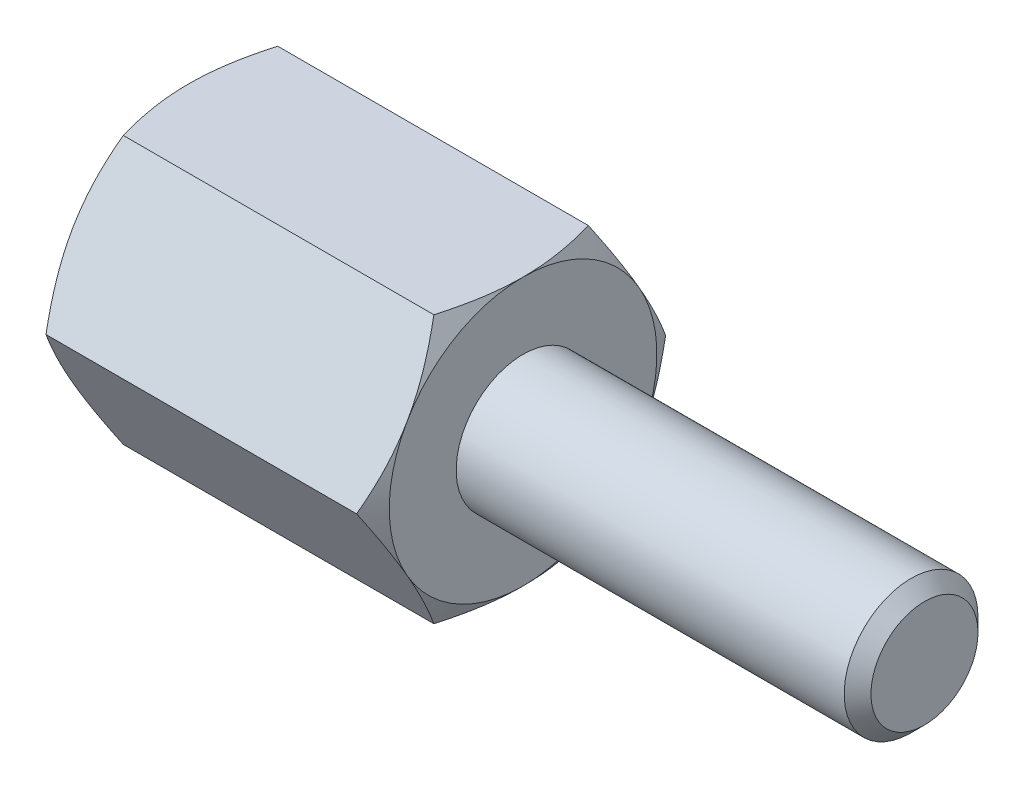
ISO-10303-21;
HEADER;
FILE_DESCRIPTION(('STEP AP214'),'2;1');
FILE_NAME('part.step','',(''),(''),'','','');
FILE_SCHEMA(('AUTOMOTIVE_DESIGN { 1 0 10303 214 1 1 1 1 }'));
ENDSEC;
DATA;
#1=APPLICATION_CONTEXT('core data for automotive mechanical design processes');
#2=APPLICATION_PROTOCOL_DEFINITION('international standard','automotive_design',2000,#1);
#3=PRODUCT_CONTEXT('',#1,'mechanical');
#4=PRODUCT('Part','Part','',(#3));
#5=PRODUCT_RELATED_PRODUCT_CATEGORY('part','',(#4));
#6=PRODUCT_DEFINITION_FORMATION('','',#4);
#7=PRODUCT_DEFINITION_CONTEXT('part definition',#1,'design');
#8=PRODUCT_DEFINITION('design','',#6,#7);
#9=PRODUCT_DEFINITION_SHAPE('','',#8);
#10=(LENGTH_UNIT() NAMED_UNIT(*) SI_UNIT(.MILLI.,.METRE.));
#11=(NAMED_UNIT(*) PLANE_ANGLE_UNIT() SI_UNIT($,.RADIAN.));
#12=(NAMED_UNIT(*) SI_UNIT($,.STERADIAN.) SOLID_ANGLE_UNIT());
#13=UNCERTAINTY_MEASURE_WITH_UNIT(LENGTH_MEASURE(1.E-05),#10,'distance_accuracy_value','');
#14=(GEOMETRIC_REPRESENTATION_CONTEXT(3) GLOBAL_UNCERTAINTY_ASSIGNED_CONTEXT((#13)) GLOBAL_UNIT_ASSIGNED_CONTEXT((#10,
#11,#12)) REPRESENTATION_CONTEXT('',''));
#15=CARTESIAN_POINT('',(0.,0.,0.));
#16=DIRECTION('',(0.,0.,1.));
#17=DIRECTION('',(1.,0.,0.));
#18=AXIS2_PLACEMENT_3D('',#15,#16,#17);
#19=CARTESIAN_POINT('',(2.5,2.,-1.15470053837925));
#20=DIRECTION('',(1.,0.,0.));
#21=DIRECTION('',(0.,0.,-1.));
#22=AXIS2_PLACEMENT_3D('',#19,#20,#21);
#23=PLANE('',#22);
#24=CARTESIAN_POINT('',(2.5,0.,0.));
#25=DIRECTION('',(1.,0.,0.));
#26=DIRECTION('',(0.,0.,-1.));
#27=AXIS2_PLACEMENT_3D('',#24,#25,#26);
#28=CIRCLE('',#27,2.);
#29=CARTESIAN_POINT('',(2.5,-1.,-1.73205080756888));
#30=VERTEX_POINT('',#29);
#31=CARTESIAN_POINT('',(2.5,1.,-1.73205080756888));
#32=VERTEX_POINT('',#31);
#33=EDGE_CURVE('E288',#30,#32,#28,.T.);
#34=ORIENTED_EDGE('',*,*,#33,.T.);
#35=CARTESIAN_POINT('',(2.5,2.,0.));
#36=VERTEX_POINT('',#35);
#37=EDGE_CURVE('E53',#32,#36,#28,.T.);
#38=ORIENTED_EDGE('',*,*,#37,.T.);
#39=CARTESIAN_POINT('',(2.5,1.,1.73205080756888));
#40=VERTEX_POINT('',#39);
#41=EDGE_CURVE('E297',#36,#40,#28,.T.);
#42=ORIENTED_EDGE('',*,*,#41,.T.);
#43=CARTESIAN_POINT('',(2.5,-1.,1.73205080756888));
#44=VERTEX_POINT('',#43);
#45=EDGE_CURVE('E303',#40,#44,#28,.T.);
#46=ORIENTED_EDGE('',*,*,#45,.T.);
#47=CARTESIAN_POINT('',(2.5,0.,0.));
#48=DIRECTION('',(-1.,0.,0.));
#49=DIRECTION('',(0.,-1.,0.));
#50=AXIS2_PLACEMENT_3D('',#47,#48,#49);
#51=CIRCLE('',#50,2.);
#52=CARTESIAN_POINT('',(2.5,-2.,0.));
#53=VERTEX_POINT('',#52);
#54=EDGE_CURVE('E193',#53,#44,#51,.T.);
#55=ORIENTED_EDGE('',*,*,#54,.F.);
#56=EDGE_CURVE('E61',#53,#30,#28,.T.);
#57=ORIENTED_EDGE('',*,*,#56,.T.);
#58=EDGE_LOOP('',(#34,#38,#42,#46,#55,#57));
#59=FACE_BOUND('',#58,.T.);
#60=CARTESIAN_POINT('',(2.5,0.,0.));
#61=DIRECTION('',(1.,0.,0.));
#62=DIRECTION('',(0.,0.,-1.));
#63=AXIS2_PLACEMENT_3D('',#60,#61,#62);
#64=CIRCLE('',#63,1.);
#65=CARTESIAN_POINT('',(2.5,0.,-1.));
#66=VERTEX_POINT('',#65);
#67=EDGE_CURVE('E320',#66,#66,#64,.T.);
#68=ORIENTED_EDGE('',*,*,#67,.F.);
#69=EDGE_LOOP('',(#68));
#70=FACE_BOUND('',#69,.T.);
#71=ADVANCED_FACE('F37',(#59,#70),#23,.T.);
#72=CARTESIAN_POINT('',(2.5,0.,-2.3094010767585));
#73=DIRECTION('',(0.,-0.5,0.866025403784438));
#74=DIRECTION('',(0.,-0.866025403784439,-0.5));
#75=AXIS2_PLACEMENT_3D('',#72,#73,#74);
#76=PLANE('',#75);
#77=CARTESIAN_POINT('',(2.3213005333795,-0.00020000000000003,-2.30951654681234));
#78=CARTESIAN_POINT('',(2.35061046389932,0.0876912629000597,-2.25877250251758));
#79=CARTESIAN_POINT('',(2.37726714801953,0.176341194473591,-2.20759044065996));
#80=CARTESIAN_POINT('',(2.42379750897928,0.355176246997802,-2.10433997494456));
#81=CARTESIAN_POINT('',(2.44365472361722,0.445364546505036,-2.05226973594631));
#82=CARTESIAN_POINT('',(2.47456653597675,0.624623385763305,-1.94877459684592));
#83=CARTESIAN_POINT('',(2.48582684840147,0.713666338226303,-1.89736562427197));
#84=CARTESIAN_POINT('',(2.49927133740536,0.892171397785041,-1.79430568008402));
#85=CARTESIAN_POINT('',(2.50146664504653,0.981632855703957,-1.74265508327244));
#86=CARTESIAN_POINT('',(2.49690901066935,1.1488083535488,-1.64613626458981));
#87=CARTESIAN_POINT('',(2.49127512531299,1.22654737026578,-1.60125362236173));
#88=CARTESIAN_POINT('',(2.47341610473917,1.38151891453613,-1.51178075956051));
#89=CARTESIAN_POINT('',(2.46118486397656,1.4587509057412,-1.46719084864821));
#90=CARTESIAN_POINT('',(2.43060656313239,1.6140421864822,-1.37753338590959));
#91=CARTESIAN_POINT('',(2.41212983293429,1.69208181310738,-1.33247718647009));
#92=CARTESIAN_POINT('',(2.37019448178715,1.84699686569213,-1.24303693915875));
#93=CARTESIAN_POINT('',(2.34674571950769,1.92387427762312,-1.1986517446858));
#94=CARTESIAN_POINT('',(2.32130053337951,2.0002,-1.15458506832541));
#95=B_SPLINE_CURVE_WITH_KNOTS('',3,(#77,#78,#79,#80,#81,#82,#83,#84,#85,#86,#87,#88,#89,#90,#91,
#92,#93,#94),.UNSPECIFIED.,.F.,.F.,(4,2,2,2,2,2,2,2,4),(0.,0.317031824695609,0.634825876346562,
0.944753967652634,1.25430138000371,1.52387047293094,1.79368946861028,2.06949491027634,
2.34475850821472),.UNSPECIFIED.);
#96=CARTESIAN_POINT('',(2.32136720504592,0.,-2.3094010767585));
#97=VERTEX_POINT('',#96);
#98=EDGE_CURVE('E328',#97,#32,#95,.T.);
#99=ORIENTED_EDGE('',*,*,#98,.F.);
#100=DIRECTION('',(-1.,0.,0.));
#101=VECTOR('',#100,1.);
#102=CARTESIAN_POINT('',(2.5,0.,-2.3094010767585));
#103=LINE('',#102,#101);
#104=CARTESIAN_POINT('',(-2.32136720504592,0.,-2.3094010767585));
#105=VERTEX_POINT('',#104);
#106=EDGE_CURVE('E264',#97,#105,#103,.T.);
#107=ORIENTED_EDGE('',*,*,#106,.T.);
#108=CARTESIAN_POINT('',(-2.3213005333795,2.0002,-1.15458506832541));
#109=CARTESIAN_POINT('',(-2.35061046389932,1.91230873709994,-1.20532911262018));
#110=CARTESIAN_POINT('',(-2.37726714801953,1.82365880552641,-1.2565111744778));
#111=CARTESIAN_POINT('',(-2.42379750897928,1.6448237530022,-1.35976164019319));
#112=CARTESIAN_POINT('',(-2.44365472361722,1.55463545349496,-1.41183187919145));
#113=CARTESIAN_POINT('',(-2.47456653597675,1.37537661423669,-1.51532701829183));
#114=CARTESIAN_POINT('',(-2.48582684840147,1.2863336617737,-1.56673599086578));
#115=CARTESIAN_POINT('',(-2.49927133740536,1.10782860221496,-1.66979593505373));
#116=CARTESIAN_POINT('',(-2.50146664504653,1.01836714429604,-1.72144653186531));
#117=CARTESIAN_POINT('',(-2.49690901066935,0.851191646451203,-1.81796535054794));
#118=CARTESIAN_POINT('',(-2.49127512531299,0.773452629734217,-1.86284799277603));
#119=CARTESIAN_POINT('',(-2.47341610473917,0.618481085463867,-1.95232085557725));
#120=CARTESIAN_POINT('',(-2.46118486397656,0.541249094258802,-1.99691076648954));
#121=CARTESIAN_POINT('',(-2.43060656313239,0.3859578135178,-2.08656822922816));
#122=CARTESIAN_POINT('',(-2.41212983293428,0.307918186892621,-2.13162442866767));
#123=CARTESIAN_POINT('',(-2.37019448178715,0.153003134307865,-2.221064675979));
#124=CARTESIAN_POINT('',(-2.34674571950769,0.07612572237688,-2.26544987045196));
#125=CARTESIAN_POINT('',(-2.3213005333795,-0.000199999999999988,-2.30951654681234));
#126=B_SPLINE_CURVE_WITH_KNOTS('',3,(#108,#109,#110,#111,#112,#113,#114,#115,#116,#117,#118,
#119,#120,#121,#122,#123,#124,#125),.UNSPECIFIED.,.F.,.F.,(4,2,2,2,2,2,2,2,4),(0.,
0.317031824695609,0.634825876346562,0.944753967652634,1.25430138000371,1.52387047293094,
1.79368946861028,2.06949491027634,2.34475850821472),.UNSPECIFIED.);
#127=CARTESIAN_POINT('',(-2.5,1.,-1.73205080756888));
#128=VERTEX_POINT('',#127);
#129=EDGE_CURVE('E380',#128,#105,#126,.T.);
#130=ORIENTED_EDGE('',*,*,#129,.F.);
#131=CARTESIAN_POINT('',(-2.32136720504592,2.,-1.15470053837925));
#132=VERTEX_POINT('',#131);
#133=EDGE_CURVE('E382',#132,#128,#126,.T.);
#134=ORIENTED_EDGE('',*,*,#133,.F.);
#135=DIRECTION('',(-1.,0.,0.));
#136=VECTOR('',#135,1.);
#137=CARTESIAN_POINT('',(2.5,2.,-1.15470053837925));
#138=LINE('',#137,#136);
#139=CARTESIAN_POINT('',(2.321367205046,2.,-1.15470053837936));
#140=VERTEX_POINT('',#139);
#141=EDGE_CURVE('E279',#140,#132,#138,.T.);
#142=ORIENTED_EDGE('',*,*,#141,.F.);
#143=EDGE_CURVE('E229',#32,#140,#95,.T.);
#144=ORIENTED_EDGE('',*,*,#143,.F.);
#145=EDGE_LOOP('',(#99,#107,#130,#134,#142,#144));
#146=FACE_BOUND('',#145,.T.);
#147=ADVANCED_FACE('F148',(#146),#76,.F.);
#148=CARTESIAN_POINT('',(2.5,2.,-1.15470053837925));
#149=DIRECTION('',(0.,-1.,0.));
#150=DIRECTION('',(0.,0.,-1.));
#151=AXIS2_PLACEMENT_3D('',#148,#149,#150);
#152=PLANE('',#151);
#153=CARTESIAN_POINT('',(1.50414535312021,2.,-3.14239762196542));
#154=CARTESIAN_POINT('',(1.5468568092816,2.,-3.05468337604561));
#155=CARTESIAN_POINT('',(1.58917030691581,2.,-2.96677207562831));
#156=CARTESIAN_POINT('',(1.67277831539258,2.,-2.79045070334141));
#157=CARTESIAN_POINT('',(1.71407267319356,2.,-2.70204055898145));
#158=CARTESIAN_POINT('',(1.79561838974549,2.,-2.52418069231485));
#159=CARTESIAN_POINT('',(1.83586319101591,2.,-2.43472795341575));
#160=CARTESIAN_POINT('',(1.91475904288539,2.,-2.25512498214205));
#161=CARTESIAN_POINT('',(1.95341016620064,2.,-2.16497478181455));
#162=CARTESIAN_POINT('',(2.02996617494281,2.,-1.98078525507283));
#163=CARTESIAN_POINT('',(2.06780217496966,2.,-1.88671714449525));
#164=CARTESIAN_POINT('',(2.14070044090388,2.,-1.69751412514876));
#165=CARTESIAN_POINT('',(2.17576294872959,2.,-1.60237931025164));
#166=CARTESIAN_POINT('',(2.24223535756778,2.,-1.41102905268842));
#167=CARTESIAN_POINT('',(2.27365196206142,2.,-1.31481596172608));
#168=CARTESIAN_POINT('',(2.33184764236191,2.,-1.12101028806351));
#169=CARTESIAN_POINT('',(2.3586281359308,2.,-1.02341813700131));
#170=CARTESIAN_POINT('',(2.40615162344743,2.,-0.827336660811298));
#171=CARTESIAN_POINT('',(2.4269281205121,2.,-0.728855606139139));
#172=CARTESIAN_POINT('',(2.46129559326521,2.,-0.530628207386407));
#173=CARTESIAN_POINT('',(2.47488733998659,2.,-0.430882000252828));
#174=CARTESIAN_POINT('',(2.49362159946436,2.,-0.231937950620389));
#175=CARTESIAN_POINT('',(2.49887592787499,2.,-0.132750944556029));
#176=CARTESIAN_POINT('',(2.50079968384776,2.,0.0657049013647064));
#177=CARTESIAN_POINT('',(2.4974689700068,2.,0.164973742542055));
#178=CARTESIAN_POINT('',(2.47965125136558,2.,0.4006926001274));
#179=CARTESIAN_POINT('',(2.46138848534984,2.,0.536859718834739));
#180=CARTESIAN_POINT('',(2.41179958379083,2.,0.806792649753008));
#181=CARTESIAN_POINT('',(2.38046153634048,2.,0.940556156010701));
#182=CARTESIAN_POINT('',(2.30733694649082,2.,1.20849227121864));
#183=CARTESIAN_POINT('',(2.26532316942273,2.,1.34260127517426));
#184=CARTESIAN_POINT('',(2.19701155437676,2.,1.54188460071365));
#185=CARTESIAN_POINT('',(2.17336125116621,2.,1.6079939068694));
#186=CARTESIAN_POINT('',(2.12457310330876,2.,1.73966131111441));
#187=CARTESIAN_POINT('',(2.09943529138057,2.,1.80521942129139));
#188=CARTESIAN_POINT('',(2.03045244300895,2.,1.98014362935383));
#189=CARTESIAN_POINT('',(1.98548288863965,2.,2.08906517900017));
#190=CARTESIAN_POINT('',(1.89293953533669,2.,2.3058004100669));
#191=CARTESIAN_POINT('',(1.84536546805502,2.,2.41361397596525));
#192=CARTESIAN_POINT('',(1.74822629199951,2.,2.62838132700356));
#193=CARTESIAN_POINT('',(1.69866051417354,2.,2.73533480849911));
#194=CARTESIAN_POINT('',(1.59800140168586,2.,2.94852186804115));
#195=CARTESIAN_POINT('',(1.54690802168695,2.,3.05475542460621));
#196=CARTESIAN_POINT('',(1.39169615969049,2.,3.37291303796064));
#197=CARTESIAN_POINT('',(1.28579652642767,2.,3.58396705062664));
#198=CARTESIAN_POINT('',(1.07100981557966,2.,4.00448363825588));
#199=CARTESIAN_POINT('',(0.962123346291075,2.,4.21394652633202));
#200=CARTESIAN_POINT('',(0.753767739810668,2.,4.61000648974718));
#201=CARTESIAN_POINT('',(0.654500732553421,2.,4.79671008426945));
#202=CARTESIAN_POINT('',(0.454764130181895,2.,5.16948614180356));
#203=CARTESIAN_POINT('',(0.354294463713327,2.,5.35555856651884));
#204=CARTESIAN_POINT('',(0.152793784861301,2.,5.72660635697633));
#205=CARTESIAN_POINT('',(0.051765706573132,2.,5.91158331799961));
#206=CARTESIAN_POINT('',(-0.15097604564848,2.,6.28114276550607));
#207=CARTESIAN_POINT('',(-0.252689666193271,2.,6.46572528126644));
#208=CARTESIAN_POINT('',(-0.35465292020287,2.,6.65016883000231));
#209=B_SPLINE_CURVE_WITH_KNOTS('',3,(#153,#154,#155,#156,#157,#158,#159,#160,#161,#162,#163,
#164,#165,#166,#167,#168,#169,#170,#171,#172,#173,#174,#175,#176,#177,#178,#179,#180,#181,#182,
#183,#184,#185,#186,#187,#188,#189,#190,#191,#192,#193,#194,#195,#196,#197,#198,#199,#200,#201,
#202,#203,#204,#205,#206,#207,#208),.UNSPECIFIED.,.F.,.F.,(4,2,2,2,2,2,2,2,2,2,2,2,2,2,2,2,2,2,
2,2,2,2,2,2,2,2,2,4),(0.,0.292684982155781,0.585413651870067,0.879667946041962,1.17390879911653,
1.47805164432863,1.78216793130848,2.08571589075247,2.38917085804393,2.690898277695,
2.99259331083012,3.29020694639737,3.58782548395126,3.99913738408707,4.41082482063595,
4.8321411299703,5.0427662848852,5.25338680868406,5.6068563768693,5.96036243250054,
6.31398824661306,6.66762456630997,7.37597688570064,8.08418599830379,8.71853756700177,
9.3529269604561,9.98522933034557,10.6174830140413),.UNSPECIFIED.);
#210=EDGE_CURVE('E227',#140,#36,#209,.T.);
#211=ORIENTED_EDGE('',*,*,#210,.F.);
#212=ORIENTED_EDGE('',*,*,#141,.T.);
#213=CARTESIAN_POINT('',(-1.50414535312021,2.,-3.14239762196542));
#214=CARTESIAN_POINT('',(-1.5468568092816,2.,-3.05468337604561));
#215=CARTESIAN_POINT('',(-1.58917030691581,2.,-2.96677207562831));
#216=CARTESIAN_POINT('',(-1.67277831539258,2.,-2.79045070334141));
#217=CARTESIAN_POINT('',(-1.71407267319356,2.,-2.70204055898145));
#218=CARTESIAN_POINT('',(-1.79561838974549,2.,-2.52418069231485));
#219=CARTESIAN_POINT('',(-1.83586319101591,2.,-2.43472795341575));
#220=CARTESIAN_POINT('',(-1.91475904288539,2.,-2.25512498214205));
#221=CARTESIAN_POINT('',(-1.95341016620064,2.,-2.16497478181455));
#222=CARTESIAN_POINT('',(-2.02996617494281,2.,-1.98078525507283));
#223=CARTESIAN_POINT('',(-2.06780217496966,2.,-1.88671714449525));
#224=CARTESIAN_POINT('',(-2.14070044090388,2.,-1.69751412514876));
#225=CARTESIAN_POINT('',(-2.17576294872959,2.,-1.60237931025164));
#226=CARTESIAN_POINT('',(-2.24223535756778,2.,-1.41102905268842));
#227=CARTESIAN_POINT('',(-2.27365196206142,2.,-1.31481596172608));
#228=CARTESIAN_POINT('',(-2.33184764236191,2.,-1.12101028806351));
#229=CARTESIAN_POINT('',(-2.3586281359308,2.,-1.02341813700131));
#230=CARTESIAN_POINT('',(-2.40615162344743,2.,-0.827336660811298));
#231=CARTESIAN_POINT('',(-2.4269281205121,2.,-0.728855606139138));
#232=CARTESIAN_POINT('',(-2.46129559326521,2.,-0.530628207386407));
#233=CARTESIAN_POINT('',(-2.47488733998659,2.,-0.430882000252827));
#234=CARTESIAN_POINT('',(-2.49362159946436,2.,-0.231937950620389));
#235=CARTESIAN_POINT('',(-2.49887592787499,2.,-0.132750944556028));
#236=CARTESIAN_POINT('',(-2.50079968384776,2.,0.0657049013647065));
#237=CARTESIAN_POINT('',(-2.4974689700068,2.,0.164973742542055));
#238=CARTESIAN_POINT('',(-2.47965125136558,2.,0.400692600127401));
#239=CARTESIAN_POINT('',(-2.46138848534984,2.,0.536859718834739));
#240=CARTESIAN_POINT('',(-2.41179958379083,2.,0.806792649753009));
#241=CARTESIAN_POINT('',(-2.38046153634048,2.,0.940556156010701));
#242=CARTESIAN_POINT('',(-2.30733694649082,2.,1.20849227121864));
#243=CARTESIAN_POINT('',(-2.26532316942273,2.,1.34260127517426));
#244=CARTESIAN_POINT('',(-2.19701155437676,2.,1.54188460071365));
#245=CARTESIAN_POINT('',(-2.17336125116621,2.,1.6079939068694));
#246=CARTESIAN_POINT('',(-2.12457310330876,2.,1.73966131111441));
#247=CARTESIAN_POINT('',(-2.09943529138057,2.,1.80521942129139));
#248=CARTESIAN_POINT('',(-2.03045244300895,2.,1.98014362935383));
#249=CARTESIAN_POINT('',(-1.98548288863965,2.,2.08906517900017));
#250=CARTESIAN_POINT('',(-1.89293953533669,2.,2.3058004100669));
#251=CARTESIAN_POINT('',(-1.84536546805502,2.,2.41361397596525));
#252=CARTESIAN_POINT('',(-1.74822629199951,2.,2.62838132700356));
#253=CARTESIAN_POINT('',(-1.69866051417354,2.,2.73533480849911));
#254=CARTESIAN_POINT('',(-1.59800140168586,2.,2.94852186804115));
#255=CARTESIAN_POINT('',(-1.54690802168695,2.,3.05475542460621));
#256=CARTESIAN_POINT('',(-1.39169615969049,2.,3.37291303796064));
#257=CARTESIAN_POINT('',(-1.28579652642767,2.,3.58396705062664));
#258=CARTESIAN_POINT('',(-1.07100981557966,2.,4.00448363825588));
#259=CARTESIAN_POINT('',(-0.962123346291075,2.,4.21394652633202));
#260=CARTESIAN_POINT('',(-0.753767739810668,2.,4.61000648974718));
#261=CARTESIAN_POINT('',(-0.65450073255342,2.,4.79671008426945));
#262=CARTESIAN_POINT('',(-0.454764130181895,2.,5.16948614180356));
#263=CARTESIAN_POINT('',(-0.354294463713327,2.,5.35555856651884));
#264=CARTESIAN_POINT('',(-0.152793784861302,2.,5.72660635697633));
#265=CARTESIAN_POINT('',(-0.051765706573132,2.,5.91158331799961));
#266=CARTESIAN_POINT('',(0.150976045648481,2.,6.28114276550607));
#267=CARTESIAN_POINT('',(0.252689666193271,2.,6.46572528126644));
#268=CARTESIAN_POINT('',(0.354652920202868,2.,6.65016883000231));
#269=B_SPLINE_CURVE_WITH_KNOTS('',3,(#213,#214,#215,#216,#217,#218,#219,#220,#221,#222,#223,
#224,#225,#226,#227,#228,#229,#230,#231,#232,#233,#234,#235,#236,#237,#238,#239,#240,#241,#242,
#243,#244,#245,#246,#247,#248,#249,#250,#251,#252,#253,#254,#255,#256,#257,#258,#259,#260,#261,
#262,#263,#264,#265,#266,#267,#268),.UNSPECIFIED.,.F.,.F.,(4,2,2,2,2,2,2,2,2,2,2,2,2,2,2,2,2,2,
2,2,2,2,2,2,2,2,2,4),(0.,0.292684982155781,0.585413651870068,0.879667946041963,1.17390879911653,
1.47805164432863,1.78216793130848,2.08571589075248,2.38917085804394,2.690898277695,
2.99259331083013,3.29020694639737,3.58782548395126,3.99913738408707,4.41082482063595,
4.8321411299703,5.0427662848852,5.25338680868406,5.6068563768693,5.96036243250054,
6.31398824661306,6.66762456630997,7.37597688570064,8.08418599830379,8.71853756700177,
9.3529269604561,9.98522933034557,10.6174830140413),.UNSPECIFIED.);
#270=CARTESIAN_POINT('',(-2.5,2.,0.));
#271=VERTEX_POINT('',#270);
#272=EDGE_CURVE('E241',#271,#132,#269,.F.);
#273=ORIENTED_EDGE('',*,*,#272,.F.);
#274=CARTESIAN_POINT('',(-2.32136720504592,2.,1.15470053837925));
#275=VERTEX_POINT('',#274);
#276=EDGE_CURVE('E249',#275,#271,#269,.F.);
#277=ORIENTED_EDGE('',*,*,#276,.F.);
#278=DIRECTION('',(-1.,0.,0.));
#279=VECTOR('',#278,1.);
#280=CARTESIAN_POINT('',(2.5,2.,1.15470053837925));
#281=LINE('',#280,#279);
#282=CARTESIAN_POINT('',(2.32136720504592,2.,1.15470053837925));
#283=VERTEX_POINT('',#282);
#284=EDGE_CURVE('E276',#283,#275,#281,.T.);
#285=ORIENTED_EDGE('',*,*,#284,.F.);
#286=EDGE_CURVE('E221',#36,#283,#209,.T.);
#287=ORIENTED_EDGE('',*,*,#286,.F.);
#288=EDGE_LOOP('',(#211,#212,#273,#277,#285,#287));
#289=FACE_BOUND('',#288,.T.);
#290=ADVANCED_FACE('F153',(#289),#152,.F.);
#291=CARTESIAN_POINT('',(2.5,2.,1.15470053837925));
#292=DIRECTION('',(0.,-0.5,-0.866025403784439));
#293=DIRECTION('',(0.,0.866025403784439,-0.5));
#294=AXIS2_PLACEMENT_3D('',#291,#292,#293);
#295=PLANE('',#294);
#296=CARTESIAN_POINT('',(2.3213005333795,2.0002,1.15458506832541));
#297=CARTESIAN_POINT('',(2.35061046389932,1.91230873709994,1.20532911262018));
#298=CARTESIAN_POINT('',(2.37726714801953,1.82365880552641,1.2565111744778));
#299=CARTESIAN_POINT('',(2.42379750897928,1.6448237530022,1.35976164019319));
#300=CARTESIAN_POINT('',(2.44365472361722,1.55463545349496,1.41183187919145));
#301=CARTESIAN_POINT('',(2.47456653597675,1.37537661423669,1.51532701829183));
#302=CARTESIAN_POINT('',(2.48582684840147,1.2863336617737,1.56673599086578));
#303=CARTESIAN_POINT('',(2.49927133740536,1.10782860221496,1.66979593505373));
#304=CARTESIAN_POINT('',(2.50146664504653,1.01836714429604,1.72144653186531));
#305=CARTESIAN_POINT('',(2.49690901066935,0.851191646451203,1.81796535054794));
#306=CARTESIAN_POINT('',(2.49127512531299,0.773452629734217,1.86284799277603));
#307=CARTESIAN_POINT('',(2.47341610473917,0.618481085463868,1.95232085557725));
#308=CARTESIAN_POINT('',(2.46118486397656,0.541249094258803,1.99691076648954));
#309=CARTESIAN_POINT('',(2.43060656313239,0.3859578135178,2.08656822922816));
#310=CARTESIAN_POINT('',(2.41212983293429,0.307918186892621,2.13162442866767));
#311=CARTESIAN_POINT('',(2.37019448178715,0.153003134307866,2.221064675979));
#312=CARTESIAN_POINT('',(2.34674571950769,0.0761257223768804,2.26544987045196));
#313=CARTESIAN_POINT('',(2.3213005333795,-0.000199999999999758,2.30951654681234));
#314=B_SPLINE_CURVE_WITH_KNOTS('',3,(#296,#297,#298,#299,#300,#301,#302,#303,#304,#305,#306,
#307,#308,#309,#310,#311,#312,#313),.UNSPECIFIED.,.F.,.F.,(4,2,2,2,2,2,2,2,4),(0.,
0.317031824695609,0.634825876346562,0.944753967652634,1.25430138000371,1.52387047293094,
1.79368946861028,2.06949491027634,2.34475850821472),.UNSPECIFIED.);
#315=EDGE_CURVE('E228',#283,#40,#314,.T.);
#316=ORIENTED_EDGE('',*,*,#315,.F.);
#317=ORIENTED_EDGE('',*,*,#284,.T.);
#318=CARTESIAN_POINT('',(-2.3213005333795,-0.000199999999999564,2.30951654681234));
#319=CARTESIAN_POINT('',(-2.35061046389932,0.0876912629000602,2.25877250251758));
#320=CARTESIAN_POINT('',(-2.37726714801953,0.176341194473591,2.20759044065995));
#321=CARTESIAN_POINT('',(-2.42379750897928,0.355176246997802,2.10433997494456));
#322=CARTESIAN_POINT('',(-2.44365472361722,0.445364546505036,2.0522697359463));
#323=CARTESIAN_POINT('',(-2.47456653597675,0.624623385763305,1.94877459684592));
#324=CARTESIAN_POINT('',(-2.48582684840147,0.713666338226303,1.89736562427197));
#325=CARTESIAN_POINT('',(-2.49927133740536,0.892171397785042,1.79430568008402));
#326=CARTESIAN_POINT('',(-2.50146664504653,0.981632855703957,1.74265508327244));
#327=CARTESIAN_POINT('',(-2.49690901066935,1.1488083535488,1.64613626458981));
#328=CARTESIAN_POINT('',(-2.49127512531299,1.22654737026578,1.60125362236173));
#329=CARTESIAN_POINT('',(-2.47341610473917,1.38151891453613,1.51178075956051));
#330=CARTESIAN_POINT('',(-2.46118486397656,1.4587509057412,1.46719084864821));
#331=CARTESIAN_POINT('',(-2.43060656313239,1.6140421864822,1.37753338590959));
#332=CARTESIAN_POINT('',(-2.41212983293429,1.69208181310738,1.33247718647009));
#333=CARTESIAN_POINT('',(-2.37019448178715,1.84699686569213,1.24303693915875));
#334=CARTESIAN_POINT('',(-2.34674571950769,1.92387427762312,1.1986517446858));
#335=CARTESIAN_POINT('',(-2.32130053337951,2.0002,1.15458506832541));
#336=B_SPLINE_CURVE_WITH_KNOTS('',3,(#318,#319,#320,#321,#322,#323,#324,#325,#326,#327,#328,
#329,#330,#331,#332,#333,#334,#335),.UNSPECIFIED.,.F.,.F.,(4,2,2,2,2,2,2,2,4),(0.,
0.317031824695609,0.634825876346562,0.944753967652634,1.25430138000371,1.52387047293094,
1.79368946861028,2.06949491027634,2.34475850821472),.UNSPECIFIED.);
#337=CARTESIAN_POINT('',(-2.5,1.,1.73205080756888));
#338=VERTEX_POINT('',#337);
#339=EDGE_CURVE('E255',#338,#275,#336,.T.);
#340=ORIENTED_EDGE('',*,*,#339,.F.);
#341=CARTESIAN_POINT('',(-2.32136720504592,0.,2.3094010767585));
#342=VERTEX_POINT('',#341);
#343=EDGE_CURVE('E262',#342,#338,#336,.T.);
#344=ORIENTED_EDGE('',*,*,#343,.F.);
#345=DIRECTION('',(-1.,0.,0.));
#346=VECTOR('',#345,1.);
#347=CARTESIAN_POINT('',(2.5,0.,2.3094010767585));
#348=LINE('',#347,#346);
#349=CARTESIAN_POINT('',(2.32136720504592,0.,2.3094010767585));
#350=VERTEX_POINT('',#349);
#351=EDGE_CURVE('E273',#350,#342,#348,.T.);
#352=ORIENTED_EDGE('',*,*,#351,.F.);
#353=EDGE_CURVE('E215',#40,#350,#314,.T.);
#354=ORIENTED_EDGE('',*,*,#353,.F.);
#355=EDGE_LOOP('',(#316,#317,#340,#344,#352,#354));
#356=FACE_BOUND('',#355,.T.);
#357=ADVANCED_FACE('F235',(#356),#295,.F.);
#358=CARTESIAN_POINT('',(2.5,0.,2.3094010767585));
#359=DIRECTION('',(0.,0.5,-0.866025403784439));
#360=DIRECTION('',(0.,0.866025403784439,0.5));
#361=AXIS2_PLACEMENT_3D('',#358,#359,#360);
#362=PLANE('',#361);
#363=CARTESIAN_POINT('',(2.3213005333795,0.000200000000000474,2.30951654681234));
#364=CARTESIAN_POINT('',(2.35061046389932,-0.0876912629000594,2.25877250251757));
#365=CARTESIAN_POINT('',(2.37726714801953,-0.176341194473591,2.20759044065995));
#366=CARTESIAN_POINT('',(2.42379750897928,-0.355176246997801,2.10433997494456));
#367=CARTESIAN_POINT('',(2.44365472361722,-0.445364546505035,2.0522697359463));
#368=CARTESIAN_POINT('',(2.47456653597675,-0.624623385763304,1.94877459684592));
#369=CARTESIAN_POINT('',(2.48582684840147,-0.713666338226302,1.89736562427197));
#370=CARTESIAN_POINT('',(2.49927133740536,-0.892171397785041,1.79430568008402));
#371=CARTESIAN_POINT('',(2.50146664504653,-0.981632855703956,1.74265508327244));
#372=CARTESIAN_POINT('',(2.49690901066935,-1.1488083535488,1.64613626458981));
#373=CARTESIAN_POINT('',(2.49127512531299,-1.22654737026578,1.60125362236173));
#374=CARTESIAN_POINT('',(2.47341610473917,-1.38151891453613,1.51178075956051));
#375=CARTESIAN_POINT('',(2.46118486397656,-1.4587509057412,1.46719084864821));
#376=CARTESIAN_POINT('',(2.43060656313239,-1.6140421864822,1.37753338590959));
#377=CARTESIAN_POINT('',(2.41212983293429,-1.69208181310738,1.33247718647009));
#378=CARTESIAN_POINT('',(2.37019448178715,-1.84699686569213,1.24303693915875));
#379=CARTESIAN_POINT('',(2.34674571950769,-1.92387427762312,1.1986517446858));
#380=CARTESIAN_POINT('',(2.3213005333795,-2.0002,1.15458506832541));
#381=B_SPLINE_CURVE_WITH_KNOTS('',3,(#363,#364,#365,#366,#367,#368,#369,#370,#371,#372,#373,
#374,#375,#376,#377,#378,#379,#380),.UNSPECIFIED.,.F.,.F.,(4,2,2,2,2,2,2,2,4),(0.,
0.317031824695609,0.634825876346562,0.944753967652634,1.25430138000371,1.52387047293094,
1.79368946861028,2.06949491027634,2.34475850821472),.UNSPECIFIED.);
#382=EDGE_CURVE('E421',#350,#44,#381,.T.);
#383=ORIENTED_EDGE('',*,*,#382,.F.);
#384=ORIENTED_EDGE('',*,*,#351,.T.);
#385=CARTESIAN_POINT('',(-2.3213005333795,-2.0002,1.15458506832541));
#386=CARTESIAN_POINT('',(-2.35061046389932,-1.91230873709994,1.20532911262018));
#387=CARTESIAN_POINT('',(-2.37726714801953,-1.82365880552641,1.2565111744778));
#388=CARTESIAN_POINT('',(-2.42379750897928,-1.6448237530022,1.35976164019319));
#389=CARTESIAN_POINT('',(-2.44365472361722,-1.55463545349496,1.41183187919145));
#390=CARTESIAN_POINT('',(-2.47456653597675,-1.3753766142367,1.51532701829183));
#391=CARTESIAN_POINT('',(-2.48582684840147,-1.2863336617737,1.56673599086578));
#392=CARTESIAN_POINT('',(-2.49927133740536,-1.10782860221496,1.66979593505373));
#393=CARTESIAN_POINT('',(-2.50146664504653,-1.01836714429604,1.72144653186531));
#394=CARTESIAN_POINT('',(-2.49690901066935,-0.851191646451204,1.81796535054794));
#395=CARTESIAN_POINT('',(-2.49127512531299,-0.773452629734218,1.86284799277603));
#396=CARTESIAN_POINT('',(-2.47341610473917,-0.618481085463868,1.95232085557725));
#397=CARTESIAN_POINT('',(-2.46118486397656,-0.541249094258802,1.99691076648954));
#398=CARTESIAN_POINT('',(-2.43060656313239,-0.3859578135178,2.08656822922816));
#399=CARTESIAN_POINT('',(-2.41212983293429,-0.307918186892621,2.13162442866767));
#400=CARTESIAN_POINT('',(-2.37019448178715,-0.153003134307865,2.221064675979));
#401=CARTESIAN_POINT('',(-2.34674571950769,-0.0761257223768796,2.26544987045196));
#402=CARTESIAN_POINT('',(-2.3213005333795,0.000200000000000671,2.30951654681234));
#403=B_SPLINE_CURVE_WITH_KNOTS('',3,(#385,#386,#387,#388,#389,#390,#391,#392,#393,#394,#395,
#396,#397,#398,#399,#400,#401,#402),.UNSPECIFIED.,.F.,.F.,(4,2,2,2,2,2,2,2,4),(0.,
0.317031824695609,0.634825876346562,0.944753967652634,1.25430138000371,1.52387047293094,
1.79368946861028,2.06949491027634,2.34475850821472),.UNSPECIFIED.);
#404=CARTESIAN_POINT('',(-2.5,-1.,1.73205080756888));
#405=VERTEX_POINT('',#404);
#406=EDGE_CURVE('E263',#405,#342,#403,.T.);
#407=ORIENTED_EDGE('',*,*,#406,.F.);
#408=CARTESIAN_POINT('',(-2.32136720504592,-2.,1.15470053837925));
#409=VERTEX_POINT('',#408);
#410=EDGE_CURVE('E250',#409,#405,#403,.T.);
#411=ORIENTED_EDGE('',*,*,#410,.F.);
#412=DIRECTION('',(-1.,0.,0.));
#413=VECTOR('',#412,1.);
#414=CARTESIAN_POINT('',(2.5,-2.,1.15470053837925));
#415=LINE('',#414,#413);
#416=CARTESIAN_POINT('',(2.32136720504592,-2.,1.15470053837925));
#417=VERTEX_POINT('',#416);
#418=EDGE_CURVE('E270',#417,#409,#415,.T.);
#419=ORIENTED_EDGE('',*,*,#418,.F.);
#420=EDGE_CURVE('E210',#44,#417,#381,.T.);
#421=ORIENTED_EDGE('',*,*,#420,.F.);
#422=EDGE_LOOP('',(#383,#384,#407,#411,#419,#421));
#423=FACE_BOUND('',#422,.T.);
#424=ADVANCED_FACE('F420',(#423),#362,.F.);
#425=CARTESIAN_POINT('',(2.5,-2.,1.15470053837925));
#426=DIRECTION('',(0.,1.,0.));
#427=DIRECTION('',(0.,0.,1.));
#428=AXIS2_PLACEMENT_3D('',#425,#426,#427);
#429=PLANE('',#428);
#430=CARTESIAN_POINT('',(1.50414535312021,-2.,-3.14239762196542));
#431=CARTESIAN_POINT('',(1.5468568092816,-2.,-3.05468337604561));
#432=CARTESIAN_POINT('',(1.58917030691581,-2.,-2.96677207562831));
#433=CARTESIAN_POINT('',(1.67277831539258,-2.,-2.79045070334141));
#434=CARTESIAN_POINT('',(1.71407267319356,-2.,-2.70204055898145));
#435=CARTESIAN_POINT('',(1.79561838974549,-2.,-2.52418069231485));
#436=CARTESIAN_POINT('',(1.83586319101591,-2.,-2.43472795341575));
#437=CARTESIAN_POINT('',(1.91475904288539,-2.,-2.25512498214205));
#438=CARTESIAN_POINT('',(1.95341016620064,-2.,-2.16497478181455));
#439=CARTESIAN_POINT('',(2.02996617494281,-2.,-1.98078525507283));
#440=CARTESIAN_POINT('',(2.06780217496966,-2.,-1.88671714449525));
#441=CARTESIAN_POINT('',(2.14070044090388,-2.,-1.69751412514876));
#442=CARTESIAN_POINT('',(2.17576294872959,-2.,-1.60237931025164));
#443=CARTESIAN_POINT('',(2.24223535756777,-2.,-1.41102905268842));
#444=CARTESIAN_POINT('',(2.27365196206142,-2.,-1.31481596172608));
#445=CARTESIAN_POINT('',(2.33184764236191,-2.,-1.12101028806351));
#446=CARTESIAN_POINT('',(2.3586281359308,-2.,-1.02341813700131));
#447=CARTESIAN_POINT('',(2.40615162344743,-2.,-0.827336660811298));
#448=CARTESIAN_POINT('',(2.4269281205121,-2.,-0.728855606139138));
#449=CARTESIAN_POINT('',(2.46129559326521,-2.,-0.530628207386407));
#450=CARTESIAN_POINT('',(2.47488733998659,-2.,-0.430882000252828));
#451=CARTESIAN_POINT('',(2.49362159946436,-2.,-0.231937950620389));
#452=CARTESIAN_POINT('',(2.49887592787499,-2.,-0.132750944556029));
#453=CARTESIAN_POINT('',(2.50079968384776,-2.,0.0657049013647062));
#454=CARTESIAN_POINT('',(2.4974689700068,-2.,0.164973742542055));
#455=CARTESIAN_POINT('',(2.47965125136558,-2.,0.4006926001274));
#456=CARTESIAN_POINT('',(2.46138848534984,-2.,0.536859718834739));
#457=CARTESIAN_POINT('',(2.41179958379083,-2.,0.806792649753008));
#458=CARTESIAN_POINT('',(2.38046153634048,-2.,0.940556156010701));
#459=CARTESIAN_POINT('',(2.30733694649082,-2.,1.20849227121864));
#460=CARTESIAN_POINT('',(2.26532316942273,-2.,1.34260127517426));
#461=CARTESIAN_POINT('',(2.19701155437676,-2.,1.54188460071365));
#462=CARTESIAN_POINT('',(2.17336125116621,-2.,1.6079939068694));
#463=CARTESIAN_POINT('',(2.12457310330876,-2.,1.73966131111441));
#464=CARTESIAN_POINT('',(2.09943529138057,-2.,1.80521942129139));
#465=CARTESIAN_POINT('',(2.03045244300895,-2.,1.98014362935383));
#466=CARTESIAN_POINT('',(1.98548288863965,-2.,2.08906517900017));
#467=CARTESIAN_POINT('',(1.89293953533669,-2.,2.3058004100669));
#468=CARTESIAN_POINT('',(1.84536546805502,-2.,2.41361397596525));
#469=CARTESIAN_POINT('',(1.74822629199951,-2.,2.62838132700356));
#470=CARTESIAN_POINT('',(1.69866051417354,-2.,2.7353348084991));
#471=CARTESIAN_POINT('',(1.59800140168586,-2.,2.94852186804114));
#472=CARTESIAN_POINT('',(1.54690802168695,-2.,3.05475542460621));
#473=CARTESIAN_POINT('',(1.39169615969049,-2.,3.37291303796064));
#474=CARTESIAN_POINT('',(1.28579652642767,-2.,3.58396705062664));
#475=CARTESIAN_POINT('',(1.07100981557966,-2.,4.00448363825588));
#476=CARTESIAN_POINT('',(0.962123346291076,-2.,4.21394652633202));
#477=CARTESIAN_POINT('',(0.753767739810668,-2.,4.61000648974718));
#478=CARTESIAN_POINT('',(0.654500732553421,-2.,4.79671008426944));
#479=CARTESIAN_POINT('',(0.454764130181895,-2.,5.16948614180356));
#480=CARTESIAN_POINT('',(0.354294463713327,-2.,5.35555856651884));
#481=CARTESIAN_POINT('',(0.152793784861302,-2.,5.72660635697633));
#482=CARTESIAN_POINT('',(0.0517657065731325,-2.,5.9115833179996));
#483=CARTESIAN_POINT('',(-0.15097604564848,-2.,6.28114276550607));
#484=CARTESIAN_POINT('',(-0.25268966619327,-2.,6.46572528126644));
#485=CARTESIAN_POINT('',(-0.354652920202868,-2.,6.65016883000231));
#486=B_SPLINE_CURVE_WITH_KNOTS('',3,(#430,#431,#432,#433,#434,#435,#436,#437,#438,#439,#440,
#441,#442,#443,#444,#445,#446,#447,#448,#449,#450,#451,#452,#453,#454,#455,#456,#457,#458,#459,
#460,#461,#462,#463,#464,#465,#466,#467,#468,#469,#470,#471,#472,#473,#474,#475,#476,#477,#478,
#479,#480,#481,#482,#483,#484,#485),.UNSPECIFIED.,.F.,.F.,(4,2,2,2,2,2,2,2,2,2,2,2,2,2,2,2,2,2,
2,2,2,2,2,2,2,2,2,4),(0.,0.29268498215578,0.585413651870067,0.879667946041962,1.17390879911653,
1.47805164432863,1.78216793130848,2.08571589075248,2.38917085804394,2.690898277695,
2.99259331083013,3.29020694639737,3.58782548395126,3.99913738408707,4.41082482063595,
4.83214112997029,5.0427662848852,5.25338680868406,5.6068563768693,5.96036243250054,
6.31398824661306,6.66762456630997,7.37597688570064,8.08418599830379,8.71853756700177,
9.3529269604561,9.98522933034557,10.6174830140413),.UNSPECIFIED.);
#487=EDGE_CURVE('E325',#417,#53,#486,.F.);
#488=ORIENTED_EDGE('',*,*,#487,.F.);
#489=ORIENTED_EDGE('',*,*,#418,.T.);
#490=CARTESIAN_POINT('',(-1.50414535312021,-2.,-3.14239762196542));
#491=CARTESIAN_POINT('',(-1.5468568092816,-2.,-3.05468337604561));
#492=CARTESIAN_POINT('',(-1.58917030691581,-2.,-2.96677207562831));
#493=CARTESIAN_POINT('',(-1.67277831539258,-2.,-2.79045070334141));
#494=CARTESIAN_POINT('',(-1.71407267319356,-2.,-2.70204055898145));
#495=CARTESIAN_POINT('',(-1.79561838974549,-2.,-2.52418069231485));
#496=CARTESIAN_POINT('',(-1.83586319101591,-2.,-2.43472795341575));
#497=CARTESIAN_POINT('',(-1.91475904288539,-2.,-2.25512498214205));
#498=CARTESIAN_POINT('',(-1.95341016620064,-2.,-2.16497478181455));
#499=CARTESIAN_POINT('',(-2.02996617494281,-2.,-1.98078525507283));
#500=CARTESIAN_POINT('',(-2.06780217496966,-2.,-1.88671714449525));
#501=CARTESIAN_POINT('',(-2.14070044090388,-2.,-1.69751412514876));
#502=CARTESIAN_POINT('',(-2.17576294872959,-2.,-1.60237931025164));
#503=CARTESIAN_POINT('',(-2.24223535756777,-2.,-1.41102905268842));
#504=CARTESIAN_POINT('',(-2.27365196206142,-2.,-1.31481596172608));
#505=CARTESIAN_POINT('',(-2.33184764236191,-2.,-1.12101028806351));
#506=CARTESIAN_POINT('',(-2.3586281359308,-2.,-1.02341813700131));
#507=CARTESIAN_POINT('',(-2.40615162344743,-2.,-0.827336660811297));
#508=CARTESIAN_POINT('',(-2.4269281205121,-2.,-0.728855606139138));
#509=CARTESIAN_POINT('',(-2.46129559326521,-2.,-0.530628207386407));
#510=CARTESIAN_POINT('',(-2.47488733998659,-2.,-0.430882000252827));
#511=CARTESIAN_POINT('',(-2.49362159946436,-2.,-0.231937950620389));
#512=CARTESIAN_POINT('',(-2.49887592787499,-2.,-0.132750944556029));
#513=CARTESIAN_POINT('',(-2.50079968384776,-2.,0.0657049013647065));
#514=CARTESIAN_POINT('',(-2.4974689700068,-2.,0.164973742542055));
#515=CARTESIAN_POINT('',(-2.47965125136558,-2.,0.4006926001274));
#516=CARTESIAN_POINT('',(-2.46138848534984,-2.,0.536859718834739));
#517=CARTESIAN_POINT('',(-2.41179958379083,-2.,0.806792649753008));
#518=CARTESIAN_POINT('',(-2.38046153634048,-2.,0.940556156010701));
#519=CARTESIAN_POINT('',(-2.30733694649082,-2.,1.20849227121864));
#520=CARTESIAN_POINT('',(-2.26532316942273,-2.,1.34260127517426));
#521=CARTESIAN_POINT('',(-2.19701155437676,-2.,1.54188460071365));
#522=CARTESIAN_POINT('',(-2.17336125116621,-2.,1.6079939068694));
#523=CARTESIAN_POINT('',(-2.12457310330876,-2.,1.73966131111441));
#524=CARTESIAN_POINT('',(-2.09943529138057,-2.,1.80521942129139));
#525=CARTESIAN_POINT('',(-2.03045244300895,-2.,1.98014362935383));
#526=CARTESIAN_POINT('',(-1.98548288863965,-2.,2.08906517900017));
#527=CARTESIAN_POINT('',(-1.89293953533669,-2.,2.3058004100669));
#528=CARTESIAN_POINT('',(-1.84536546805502,-2.,2.41361397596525));
#529=CARTESIAN_POINT('',(-1.74822629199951,-2.,2.62838132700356));
#530=CARTESIAN_POINT('',(-1.69866051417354,-2.,2.7353348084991));
#531=CARTESIAN_POINT('',(-1.59800140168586,-2.,2.94852186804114));
#532=CARTESIAN_POINT('',(-1.54690802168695,-2.,3.05475542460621));
#533=CARTESIAN_POINT('',(-1.39169615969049,-2.,3.37291303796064));
#534=CARTESIAN_POINT('',(-1.28579652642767,-2.,3.58396705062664));
#535=CARTESIAN_POINT('',(-1.07100981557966,-2.,4.00448363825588));
#536=CARTESIAN_POINT('',(-0.962123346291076,-2.,4.21394652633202));
#537=CARTESIAN_POINT('',(-0.753767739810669,-2.,4.61000648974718));
#538=CARTESIAN_POINT('',(-0.654500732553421,-2.,4.79671008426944));
#539=CARTESIAN_POINT('',(-0.454764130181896,-2.,5.16948614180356));
#540=CARTESIAN_POINT('',(-0.354294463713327,-2.,5.35555856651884));
#541=CARTESIAN_POINT('',(-0.152793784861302,-2.,5.72660635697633));
#542=CARTESIAN_POINT('',(-0.0517657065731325,-2.,5.9115833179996));
#543=CARTESIAN_POINT('',(0.15097604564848,-2.,6.28114276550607));
#544=CARTESIAN_POINT('',(0.252689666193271,-2.,6.46572528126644));
#545=CARTESIAN_POINT('',(0.354652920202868,-2.,6.65016883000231));
#546=B_SPLINE_CURVE_WITH_KNOTS('',3,(#490,#491,#492,#493,#494,#495,#496,#497,#498,#499,#500,
#501,#502,#503,#504,#505,#506,#507,#508,#509,#510,#511,#512,#513,#514,#515,#516,#517,#518,#519,
#520,#521,#522,#523,#524,#525,#526,#527,#528,#529,#530,#531,#532,#533,#534,#535,#536,#537,#538,
#539,#540,#541,#542,#543,#544,#545),.UNSPECIFIED.,.F.,.F.,(4,2,2,2,2,2,2,2,2,2,2,2,2,2,2,2,2,2,
2,2,2,2,2,2,2,2,2,4),(0.,0.29268498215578,0.585413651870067,0.879667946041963,1.17390879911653,
1.47805164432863,1.78216793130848,2.08571589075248,2.38917085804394,2.690898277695,
2.99259331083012,3.29020694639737,3.58782548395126,3.99913738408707,4.41082482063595,
4.83214112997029,5.0427662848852,5.25338680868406,5.60685637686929,5.96036243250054,
6.31398824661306,6.66762456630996,7.37597688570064,8.08418599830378,8.71853756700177,
9.35292696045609,9.98522933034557,10.6174830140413),.UNSPECIFIED.);
#547=CARTESIAN_POINT('',(-2.5,-2.,0.));
#548=VERTEX_POINT('',#547);
#549=EDGE_CURVE('E381',#548,#409,#546,.T.);
#550=ORIENTED_EDGE('',*,*,#549,.F.);
#551=CARTESIAN_POINT('',(-2.32136720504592,-2.,-1.15470053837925));
#552=VERTEX_POINT('',#551);
#553=EDGE_CURVE('E377',#552,#548,#546,.T.);
#554=ORIENTED_EDGE('',*,*,#553,.F.);
#555=DIRECTION('',(-1.,0.,0.));
#556=VECTOR('',#555,1.);
#557=CARTESIAN_POINT('',(2.5,-2.,-1.15470053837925));
#558=LINE('',#557,#556);
#559=CARTESIAN_POINT('',(2.32136720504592,-2.,-1.15470053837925));
#560=VERTEX_POINT('',#559);
#561=EDGE_CURVE('E267',#560,#552,#558,.T.);
#562=ORIENTED_EDGE('',*,*,#561,.F.);
#563=EDGE_CURVE('E195',#53,#560,#486,.F.);
#564=ORIENTED_EDGE('',*,*,#563,.F.);
#565=EDGE_LOOP('',(#488,#489,#550,#554,#562,#564));
#566=FACE_BOUND('',#565,.T.);
#567=ADVANCED_FACE('F172',(#566),#429,.F.);
#568=CARTESIAN_POINT('',(2.5,-2.,-1.15470053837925));
#569=DIRECTION('',(0.,0.5,0.866025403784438));
#570=DIRECTION('',(0.,-0.866025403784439,0.5));
#571=AXIS2_PLACEMENT_3D('',#568,#569,#570);
#572=PLANE('',#571);
#573=CARTESIAN_POINT('',(2.3213005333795,-2.0002,-1.15458506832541));
#574=CARTESIAN_POINT('',(2.35061046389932,-1.91230873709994,-1.20532911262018));
#575=CARTESIAN_POINT('',(2.37726714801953,-1.82365880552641,-1.2565111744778));
#576=CARTESIAN_POINT('',(2.42379750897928,-1.6448237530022,-1.35976164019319));
#577=CARTESIAN_POINT('',(2.44365472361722,-1.55463545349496,-1.41183187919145));
#578=CARTESIAN_POINT('',(2.47456653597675,-1.3753766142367,-1.51532701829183));
#579=CARTESIAN_POINT('',(2.48582684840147,-1.2863336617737,-1.56673599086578));
#580=CARTESIAN_POINT('',(2.49927133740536,-1.10782860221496,-1.66979593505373));
#581=CARTESIAN_POINT('',(2.50146664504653,-1.01836714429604,-1.72144653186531));
#582=CARTESIAN_POINT('',(2.49690901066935,-0.851191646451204,-1.81796535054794));
#583=CARTESIAN_POINT('',(2.49127512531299,-0.773452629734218,-1.86284799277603));
#584=CARTESIAN_POINT('',(2.47341610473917,-0.618481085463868,-1.95232085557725));
#585=CARTESIAN_POINT('',(2.46118486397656,-0.541249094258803,-1.99691076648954));
#586=CARTESIAN_POINT('',(2.43060656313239,-0.3859578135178,-2.08656822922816));
#587=CARTESIAN_POINT('',(2.41212983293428,-0.307918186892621,-2.13162442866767));
#588=CARTESIAN_POINT('',(2.37019448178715,-0.153003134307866,-2.221064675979));
#589=CARTESIAN_POINT('',(2.34674571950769,-0.0761257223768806,-2.26544987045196));
#590=CARTESIAN_POINT('',(2.3213005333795,0.000199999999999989,-2.30951654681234));
#591=B_SPLINE_CURVE_WITH_KNOTS('',3,(#573,#574,#575,#576,#577,#578,#579,#580,#581,#582,#583,
#584,#585,#586,#587,#588,#589,#590),.UNSPECIFIED.,.F.,.F.,(4,2,2,2,2,2,2,2,4),(0.,
0.317031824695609,0.634825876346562,0.944753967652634,1.25430138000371,1.52387047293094,
1.79368946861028,2.06949491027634,2.34475850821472),.UNSPECIFIED.);
#592=EDGE_CURVE('E192',#560,#30,#591,.T.);
#593=ORIENTED_EDGE('',*,*,#592,.F.);
#594=ORIENTED_EDGE('',*,*,#561,.T.);
#595=CARTESIAN_POINT('',(-2.3213005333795,0.000199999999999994,-2.30951654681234));
#596=CARTESIAN_POINT('',(-2.35061046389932,-0.0876912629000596,-2.25877250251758));
#597=CARTESIAN_POINT('',(-2.37726714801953,-0.176341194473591,-2.20759044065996));
#598=CARTESIAN_POINT('',(-2.42379750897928,-0.355176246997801,-2.10433997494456));
#599=CARTESIAN_POINT('',(-2.44365472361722,-0.445364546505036,-2.05226973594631));
#600=CARTESIAN_POINT('',(-2.47456653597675,-0.624623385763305,-1.94877459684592));
#601=CARTESIAN_POINT('',(-2.48582684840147,-0.713666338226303,-1.89736562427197));
#602=CARTESIAN_POINT('',(-2.49927133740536,-0.892171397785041,-1.79430568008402));
#603=CARTESIAN_POINT('',(-2.50146664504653,-0.981632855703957,-1.74265508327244));
#604=CARTESIAN_POINT('',(-2.49690901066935,-1.1488083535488,-1.64613626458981));
#605=CARTESIAN_POINT('',(-2.49127512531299,-1.22654737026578,-1.60125362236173));
#606=CARTESIAN_POINT('',(-2.47341610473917,-1.38151891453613,-1.51178075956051));
#607=CARTESIAN_POINT('',(-2.46118486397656,-1.4587509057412,-1.46719084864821));
#608=CARTESIAN_POINT('',(-2.43060656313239,-1.6140421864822,-1.37753338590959));
#609=CARTESIAN_POINT('',(-2.41212983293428,-1.69208181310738,-1.33247718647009));
#610=CARTESIAN_POINT('',(-2.37019448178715,-1.84699686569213,-1.24303693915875));
#611=CARTESIAN_POINT('',(-2.34674571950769,-1.92387427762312,-1.1986517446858));
#612=CARTESIAN_POINT('',(-2.3213005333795,-2.0002,-1.15458506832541));
#613=B_SPLINE_CURVE_WITH_KNOTS('',3,(#595,#596,#597,#598,#599,#600,#601,#602,#603,#604,#605,
#606,#607,#608,#609,#610,#611,#612),.UNSPECIFIED.,.F.,.F.,(4,2,2,2,2,2,2,2,4),(0.,
0.317031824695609,0.634825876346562,0.944753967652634,1.25430138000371,1.52387047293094,
1.79368946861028,2.06949491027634,2.34475850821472),.UNSPECIFIED.);
#614=CARTESIAN_POINT('',(-2.5,-1.,-1.73205080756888));
#615=VERTEX_POINT('',#614);
#616=EDGE_CURVE('E178',#615,#552,#613,.T.);
#617=ORIENTED_EDGE('',*,*,#616,.F.);
#618=EDGE_CURVE('E372',#105,#615,#613,.T.);
#619=ORIENTED_EDGE('',*,*,#618,.F.);
#620=ORIENTED_EDGE('',*,*,#106,.F.);
#621=EDGE_CURVE('E185',#30,#97,#591,.T.);
#622=ORIENTED_EDGE('',*,*,#621,.F.);
#623=EDGE_LOOP('',(#593,#594,#617,#619,#620,#622));
#624=FACE_BOUND('',#623,.T.);
#625=ADVANCED_FACE('F167',(#624),#572,.F.);
#626=CARTESIAN_POINT('',(-2.5,0.,0.));
#627=DIRECTION('',(1.,0.,0.));
#628=DIRECTION('',(0.,1.,0.));
#629=AXIS2_PLACEMENT_3D('',#626,#627,#628);
#630=CONICAL_SURFACE('',#629,2.,1.0471975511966);
#631=ORIENTED_EDGE('',*,*,#129,.T.);
#632=ORIENTED_EDGE('',*,*,#618,.T.);
#633=CARTESIAN_POINT('',(-2.5,0.,0.));
#634=DIRECTION('',(1.,0.,0.));
#635=DIRECTION('',(0.,0.,-1.));
#636=AXIS2_PLACEMENT_3D('',#633,#634,#635);
#637=CIRCLE('',#636,2.);
#638=EDGE_CURVE('E282',#615,#128,#637,.T.);
#639=ORIENTED_EDGE('',*,*,#638,.T.);
#640=EDGE_LOOP('',(#631,#632,#639));
#641=FACE_BOUND('',#640,.T.);
#642=ADVANCED_FACE('F171',(#641),#630,.T.);
#643=ORIENTED_EDGE('',*,*,#553,.T.);
#644=EDGE_CURVE('E286',#548,#615,#637,.T.);
#645=ORIENTED_EDGE('',*,*,#644,.T.);
#646=ORIENTED_EDGE('',*,*,#616,.T.);
#647=EDGE_LOOP('',(#643,#645,#646));
#648=FACE_BOUND('',#647,.T.);
#649=ADVANCED_FACE('F456',(#648),#630,.T.);
#650=ORIENTED_EDGE('',*,*,#410,.T.);
#651=CARTESIAN_POINT('',(-2.5,0.,0.));
#652=DIRECTION('',(-1.,0.,0.));
#653=DIRECTION('',(0.,-1.,0.));
#654=AXIS2_PLACEMENT_3D('',#651,#652,#653);
#655=CIRCLE('',#654,2.);
#656=EDGE_CURVE('E363',#548,#405,#655,.T.);
#657=ORIENTED_EDGE('',*,*,#656,.F.);
#658=ORIENTED_EDGE('',*,*,#549,.T.);
#659=EDGE_LOOP('',(#650,#657,#658));
#660=FACE_BOUND('',#659,.T.);
#661=ADVANCED_FACE('F447',(#660),#630,.T.);
#662=ORIENTED_EDGE('',*,*,#343,.T.);
#663=EDGE_CURVE('E316',#338,#405,#637,.T.);
#664=ORIENTED_EDGE('',*,*,#663,.T.);
#665=ORIENTED_EDGE('',*,*,#406,.T.);
#666=EDGE_LOOP('',(#662,#664,#665));
#667=FACE_BOUND('',#666,.T.);
#668=ADVANCED_FACE('F158',(#667),#630,.T.);
#669=ORIENTED_EDGE('',*,*,#339,.T.);
#670=ORIENTED_EDGE('',*,*,#276,.T.);
#671=EDGE_CURVE('E319',#271,#338,#637,.T.);
#672=ORIENTED_EDGE('',*,*,#671,.T.);
#673=EDGE_LOOP('',(#669,#670,#672));
#674=FACE_BOUND('',#673,.T.);
#675=ADVANCED_FACE('F405',(#674),#630,.T.);
#676=ORIENTED_EDGE('',*,*,#272,.T.);
#677=ORIENTED_EDGE('',*,*,#133,.T.);
#678=EDGE_CURVE('E287',#128,#271,#637,.T.);
#679=ORIENTED_EDGE('',*,*,#678,.T.);
#680=EDGE_LOOP('',(#676,#677,#679));
#681=FACE_BOUND('',#680,.T.);
#682=ADVANCED_FACE('F165',(#681),#630,.T.);
#683=CARTESIAN_POINT('',(-2.5,2.,-1.15470053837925));
#684=DIRECTION('',(1.,0.,0.));
#685=DIRECTION('',(0.,0.,-1.));
#686=AXIS2_PLACEMENT_3D('',#683,#684,#685);
#687=PLANE('',#686);
#688=CARTESIAN_POINT('',(-2.5,0.,0.));
#689=DIRECTION('',(-1.,0.,0.));
#690=DIRECTION('',(0.,0.,1.));
#691=AXIS2_PLACEMENT_3D('',#688,#689,#690);
#692=CIRCLE('',#691,0.8);
#693=CARTESIAN_POINT('',(-2.5,0.,0.8));
#694=VERTEX_POINT('',#693);
#695=EDGE_CURVE('E331',#694,#694,#692,.T.);
#696=ORIENTED_EDGE('',*,*,#695,.F.);
#697=EDGE_LOOP('',(#696));
#698=FACE_BOUND('',#697,.T.);
#699=ORIENTED_EDGE('',*,*,#678,.F.);
#700=ORIENTED_EDGE('',*,*,#638,.F.);
#701=ORIENTED_EDGE('',*,*,#644,.F.);
#702=ORIENTED_EDGE('',*,*,#656,.T.);
#703=ORIENTED_EDGE('',*,*,#663,.F.);
#704=ORIENTED_EDGE('',*,*,#671,.F.);
#705=EDGE_LOOP('',(#699,#700,#701,#702,#703,#704));
#706=FACE_BOUND('',#705,.T.);
#707=ADVANCED_FACE('F161',(#698,#706),#687,.F.);
#708=CARTESIAN_POINT('',(2.5,0.,0.));
#709=DIRECTION('',(-1.,0.,0.));
#710=DIRECTION('',(0.,1.,0.));
#711=AXIS2_PLACEMENT_3D('',#708,#709,#710);
#712=CONICAL_SURFACE('',#711,2.,1.0471975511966);
#713=ORIENTED_EDGE('',*,*,#98,.T.);
#714=ORIENTED_EDGE('',*,*,#33,.F.);
#715=ORIENTED_EDGE('',*,*,#621,.T.);
#716=EDGE_LOOP('',(#713,#714,#715));
#717=FACE_BOUND('',#716,.T.);
#718=ADVANCED_FACE('F164',(#717),#712,.T.);
#719=ORIENTED_EDGE('',*,*,#563,.T.);
#720=ORIENTED_EDGE('',*,*,#592,.T.);
#721=ORIENTED_EDGE('',*,*,#56,.F.);
#722=EDGE_LOOP('',(#719,#720,#721));
#723=FACE_BOUND('',#722,.T.);
#724=ADVANCED_FACE('F202',(#723),#712,.T.);
#725=ORIENTED_EDGE('',*,*,#420,.T.);
#726=ORIENTED_EDGE('',*,*,#487,.T.);
#727=ORIENTED_EDGE('',*,*,#54,.T.);
#728=EDGE_LOOP('',(#725,#726,#727));
#729=FACE_BOUND('',#728,.T.);
#730=ADVANCED_FACE('F341',(#729),#712,.T.);
#731=ORIENTED_EDGE('',*,*,#353,.T.);
#732=ORIENTED_EDGE('',*,*,#382,.T.);
#733=ORIENTED_EDGE('',*,*,#45,.F.);
#734=EDGE_LOOP('',(#731,#732,#733));
#735=FACE_BOUND('',#734,.T.);
#736=ADVANCED_FACE('F423',(#735),#712,.T.);
#737=ORIENTED_EDGE('',*,*,#286,.T.);
#738=ORIENTED_EDGE('',*,*,#315,.T.);
#739=ORIENTED_EDGE('',*,*,#41,.F.);
#740=EDGE_LOOP('',(#737,#738,#739));
#741=FACE_BOUND('',#740,.T.);
#742=ADVANCED_FACE('F425',(#741),#712,.T.);
#743=ORIENTED_EDGE('',*,*,#143,.T.);
#744=ORIENTED_EDGE('',*,*,#210,.T.);
#745=ORIENTED_EDGE('',*,*,#37,.F.);
#746=EDGE_LOOP('',(#743,#744,#745));
#747=FACE_BOUND('',#746,.T.);
#748=ADVANCED_FACE('F143',(#747),#712,.T.);
#749=CARTESIAN_POINT('',(0.,0.,0.));
#750=DIRECTION('',(-1.,0.,0.));
#751=DIRECTION('',(0.,0.,1.));
#752=AXIS2_PLACEMENT_3D('',#749,#750,#751);
#753=CYLINDRICAL_SURFACE('',#752,0.8);
#754=CARTESIAN_POINT('',(0.,0.,0.));
#755=DIRECTION('',(1.,0.,0.));
#756=DIRECTION('',(0.,1.,0.));
#757=AXIS2_PLACEMENT_3D('',#754,#755,#756);
#758=CIRCLE('',#757,0.8);
#759=CARTESIAN_POINT('',(0.,0.8,0.));
#760=VERTEX_POINT('',#759);
#761=EDGE_CURVE('E323',#760,#760,#758,.T.);
#762=ORIENTED_EDGE('',*,*,#761,.T.);
#763=EDGE_LOOP('',(#762));
#764=FACE_BOUND('',#763,.T.);
#765=ORIENTED_EDGE('',*,*,#695,.T.);
#766=EDGE_LOOP('',(#765));
#767=FACE_BOUND('',#766,.T.);
#768=ADVANCED_FACE('F133',(#764,#767),#753,.F.);
#769=CARTESIAN_POINT('',(0.461880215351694,0.,0.));
#770=DIRECTION('',(-1.,0.,0.));
#771=DIRECTION('',(0.,-1.,0.));
#772=AXIS2_PLACEMENT_3D('',#769,#770,#771);
#773=CONICAL_SURFACE('',#772,0.,1.0471975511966);
#774=ORIENTED_EDGE('',*,*,#761,.F.);
#775=EDGE_LOOP('',(#774));
#776=FACE_BOUND('',#775,.T.);
#777=CARTESIAN_POINT('',(0.461880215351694,0.,0.));
#778=VERTEX_POINT('',#777);
#779=VERTEX_LOOP('',#778);
#780=FACE_BOUND('',#779,.T.);
#781=ADVANCED_FACE('F130',(#776,#780),#773,.F.);
#782=CARTESIAN_POINT('',(8.5,0.,0.));
#783=DIRECTION('',(-1.,0.,0.));
#784=DIRECTION('',(0.,0.,1.));
#785=AXIS2_PLACEMENT_3D('',#782,#783,#784);
#786=CYLINDRICAL_SURFACE('',#785,1.);
#787=CARTESIAN_POINT('',(8.3,0.,0.));
#788=DIRECTION('',(1.,0.,0.));
#789=DIRECTION('',(0.,0.,-1.));
#790=AXIS2_PLACEMENT_3D('',#787,#788,#789);
#791=CIRCLE('',#790,1.);
#792=CARTESIAN_POINT('',(8.3,0.,-1.));
#793=VERTEX_POINT('',#792);
#794=EDGE_CURVE('E11',#793,#793,#791,.F.);
#795=ORIENTED_EDGE('',*,*,#794,.T.);
#796=EDGE_LOOP('',(#795));
#797=FACE_BOUND('',#796,.T.);
#798=ORIENTED_EDGE('',*,*,#67,.T.);
#799=EDGE_LOOP('',(#798));
#800=FACE_BOUND('',#799,.T.);
#801=ADVANCED_FACE('F132',(#797,#800),#786,.T.);
#802=CARTESIAN_POINT('',(8.5,0.,0.));
#803=DIRECTION('',(1.,0.,0.));
#804=DIRECTION('',(0.,0.,-1.));
#805=AXIS2_PLACEMENT_3D('',#802,#803,#804);
#806=PLANE('',#805);
#807=CARTESIAN_POINT('',(8.5,0.,0.));
#808=DIRECTION('',(1.,0.,0.));
#809=DIRECTION('',(0.,0.,-1.));
#810=AXIS2_PLACEMENT_3D('',#807,#808,#809);
#811=CIRCLE('',#810,0.799999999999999);
#812=CARTESIAN_POINT('',(8.5,0.,-0.799999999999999));
#813=VERTEX_POINT('',#812);
#814=EDGE_CURVE('E46',#813,#813,#811,.T.);
#815=ORIENTED_EDGE('',*,*,#814,.T.);
#816=EDGE_LOOP('',(#815));
#817=FACE_BOUND('',#816,.T.);
#818=ADVANCED_FACE('F140',(#817),#806,.T.);
#819=CARTESIAN_POINT('',(8.5,0.,0.));
#820=DIRECTION('',(-1.,0.,0.));
#821=DIRECTION('',(0.,0.,1.));
#822=AXIS2_PLACEMENT_3D('',#819,#820,#821);
#823=CONICAL_SURFACE('',#822,0.799999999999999,0.78539816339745);
#824=ORIENTED_EDGE('',*,*,#794,.F.);
#825=EDGE_LOOP('',(#824));
#826=FACE_BOUND('',#825,.T.);
#827=ORIENTED_EDGE('',*,*,#814,.F.);
#828=EDGE_LOOP('',(#827));
#829=FACE_BOUND('',#828,.T.);
#830=ADVANCED_FACE('F39',(#826,#829),#823,.T.);
#831=CLOSED_SHELL('',(#71,#147,#290,#357,#424,#567,#625,#642,#649,#661,#668,#675,#682,#707,#718,
#724,#730,#736,#742,#748,#768,#781,#801,#818,#830));
#832=MANIFOLD_SOLID_BREP('B2',#831);
#833=ADVANCED_BREP_SHAPE_REPRESENTATION('',(#18,#832),#14);
#834=SHAPE_DEFINITION_REPRESENTATION(#9,#833);
ENDSEC;
END-ISO-10303-21;
